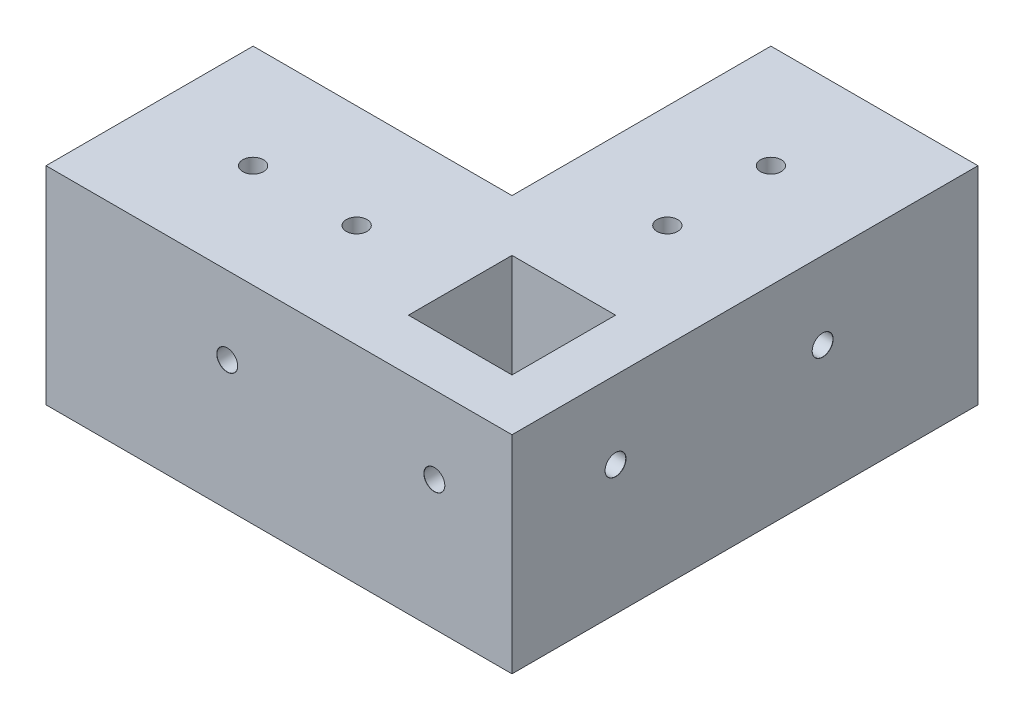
from build123d import *

# Parameters (mm, degrees)
BOSS_EXTRUDE1_DEPTH             = 40
F_4_0MM_DOWEL_HOLE1_D           = 4
F_4_0MM_DOWEL_HOLE1_DEPTH       = 10
F_4_0MM_DOWEL_HOLE1_CSINK_D     = 4.05
F_4_0MM_DOWEL_HOLE1_CSINK_ANGLE = 90
F_4_0MM_DOWEL_HOLE1_TIP         = 1.201721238
F_4_0MM_DOWEL_HOLE3_D           = 4
F_4_0MM_DOWEL_HOLE3_DEPTH       = 10
F_4_0MM_DOWEL_HOLE3_CSINK_D     = 4.05
F_4_0MM_DOWEL_HOLE3_CSINK_ANGLE = 90
F_4_0MM_DOWEL_HOLE3_TIP         = 1.201721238
SKETCH17_W                      = 20
SKETCH17_H                      = 20
CUT_EXTRUDE3_DEPTH              = 30
FILLET1_R                       = 5
SKETCH18_R                      = 2
CUT_EXTRUDE4_DEPTH              = 15


with BuildPart() as part:
    # Sketch2 → Boss-Extrude1 (new body)
    with BuildSketch(Plane(origin=(0, 0, 0), x_dir=(1, 0, 0), z_dir=(0, 1, 0))):
        Polygon((0, 0), (-50, 0), (-50, -40), (40, -40), (40, 50), (0, 50), align=None)
    extrude(amount=BOSS_EXTRUDE1_DEPTH)

    # 4.0mm Dowel Hole1
    with Locations(Plane(origin=(40, 0, 0), x_dir=(0, 0, -1), z_dir=(1, 0, 0))):
        with Locations((-20, 25), (-20, -5), (20, 25), (20, -5)):
            CounterSinkHole(F_4_0MM_DOWEL_HOLE1_D / 2, F_4_0MM_DOWEL_HOLE1_CSINK_D / 2, depth=F_4_0MM_DOWEL_HOLE1_DEPTH, counter_sink_angle=F_4_0MM_DOWEL_HOLE1_CSINK_ANGLE)
            with Locations((0, 0, -(F_4_0MM_DOWEL_HOLE1_DEPTH + F_4_0MM_DOWEL_HOLE1_TIP / 2))):  # 118° drill point
                Cone(0, F_4_0MM_DOWEL_HOLE1_D / 2, F_4_0MM_DOWEL_HOLE1_TIP, mode=Mode.SUBTRACT)

    # 4.0mm Dowel Hole3
    with Locations(Plane.XY.offset(40)):
        with Locations((25, 25), (25, -5), (-15, 25), (-15, -5)):
            CounterSinkHole(F_4_0MM_DOWEL_HOLE3_D / 2, F_4_0MM_DOWEL_HOLE3_CSINK_D / 2, depth=F_4_0MM_DOWEL_HOLE3_DEPTH, counter_sink_angle=F_4_0MM_DOWEL_HOLE3_CSINK_ANGLE)
            with Locations((0, 0, -(F_4_0MM_DOWEL_HOLE3_DEPTH + F_4_0MM_DOWEL_HOLE3_TIP / 2))):  # 118° drill point
                Cone(0, F_4_0MM_DOWEL_HOLE3_D / 2, F_4_0MM_DOWEL_HOLE3_TIP, mode=Mode.SUBTRACT)

    # Sketch17 → Cut-Extrude3 (cut)
    with BuildSketch(Plane(origin=(0, 40, 0), x_dir=(1, 0, 0), z_dir=(0, 1, 0))):
        with Locations((20, -20)):
            Rectangle(SKETCH17_W, SKETCH17_H)
    extrude(amount=-CUT_EXTRUDE3_DEPTH, mode=Mode.SUBTRACT)

    # Fillet1
    fillet1_edges = [part.edges().sort_by_distance(p)[0] for p in [
        (-25, 0, 0),
        (0, 0, -25),
    ]]
    fillet(fillet1_edges, radius=FILLET1_R)

    # Sketch18 → Cut-Extrude4 (cut)
    with BuildSketch(Plane(origin=(0, 40, 0), x_dir=(1, 0, 0), z_dir=(0, 1, 0))):
        with Locations(Location((-30, -20, 0), (0, 0, 270))):
            Circle(SKETCH18_R)
        with Locations(Location((-10, -20, 0), (0, 0, 270))):
            Circle(SKETCH18_R)
        with Locations(Location((20, 30, 0), (0, 0, 270))):
            Circle(SKETCH18_R)
        with Locations(Location((20, 10, 0), (0, 0, 270))):
            Circle(SKETCH18_R)
    extrude(amount=-CUT_EXTRUDE4_DEPTH, mode=Mode.SUBTRACT)


solid = part.part
